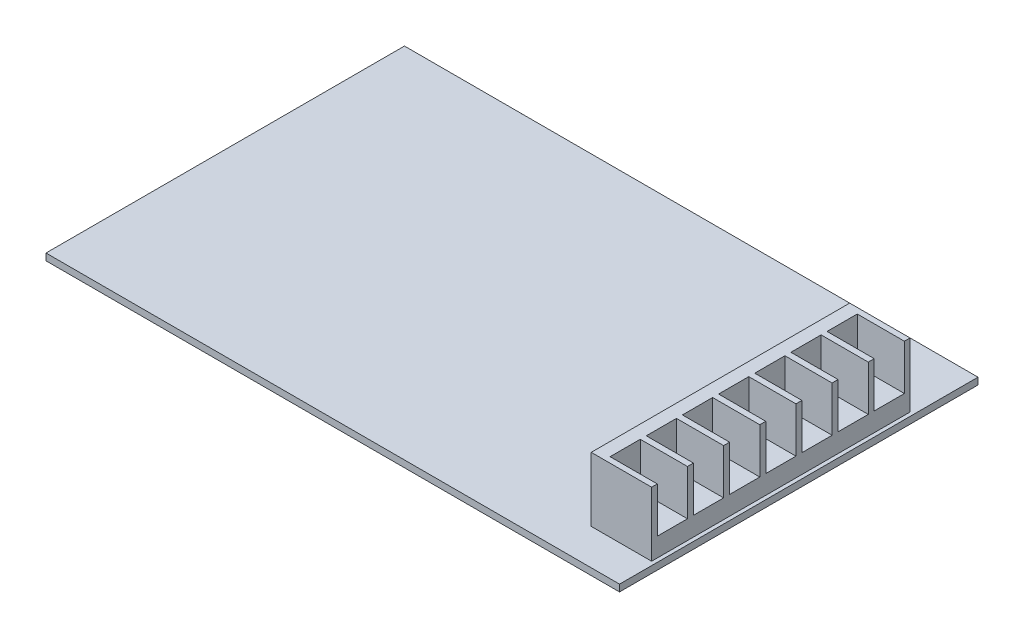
from build123d import *

# Parameters (mm, degrees)
SKETCH_1_W          = 152
SKETCH_1_H          = 95
EXTRUDE_1_DEPTH     = 1.8
SKETCH_2_W          = 16
SKETCH_2_H          = 68.5
EXTRUDE_2_DEPTH     = 17
SKETCH_3_W          = 12.5
SKETCH_3_H          = 8
CUT_EXTRUDE_1_DEPTH = 12


with BuildPart() as part:
    # Sketch 1 → Extrude 1 (new body)
    with BuildSketch(Plane(origin=(0, 0, 0), x_dir=(1, 0, 0), z_dir=(0, 1, 0))):
        Rectangle(SKETCH_1_W, SKETCH_1_H)
    extrude(amount=EXTRUDE_1_DEPTH)

    # Sketch 2 → Extrude 2 (add)
    with BuildSketch(Plane(origin=(0, 1.8, 0), x_dir=(1, 0, 0), z_dir=(0, 1, 0))):
        with Locations((67, -3.75)):
            Rectangle(SKETCH_2_W, SKETCH_2_H)
    extrude(amount=EXTRUDE_2_DEPTH)

    # Sketch 3 → Cut-Extrude 1 (cut)
    with BuildSketch(Plane(origin=(0, 18.8, 0), x_dir=(1, 0, 0), z_dir=(0, 1, 0))):
        with Locations((68.75, -32.5)):
            Rectangle(SKETCH_3_W, SKETCH_3_H)
        with Locations((68.75, -22.916666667)):
            Rectangle(SKETCH_3_W, SKETCH_3_H)
        with Locations((68.75, -13.333333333)):
            Rectangle(SKETCH_3_W, SKETCH_3_H)
        with Locations((68.75, -3.75)):
            Rectangle(SKETCH_3_W, SKETCH_3_H)
        with Locations((68.75, 5.833333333)):
            Rectangle(SKETCH_3_W, SKETCH_3_H)
        with Locations((68.75, 15.416666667)):
            Rectangle(SKETCH_3_W, SKETCH_3_H)
        with Locations((68.75, 25)):
            Rectangle(SKETCH_3_W, SKETCH_3_H)
    extrude(amount=-CUT_EXTRUDE_1_DEPTH, mode=Mode.SUBTRACT)


solid = part.part
